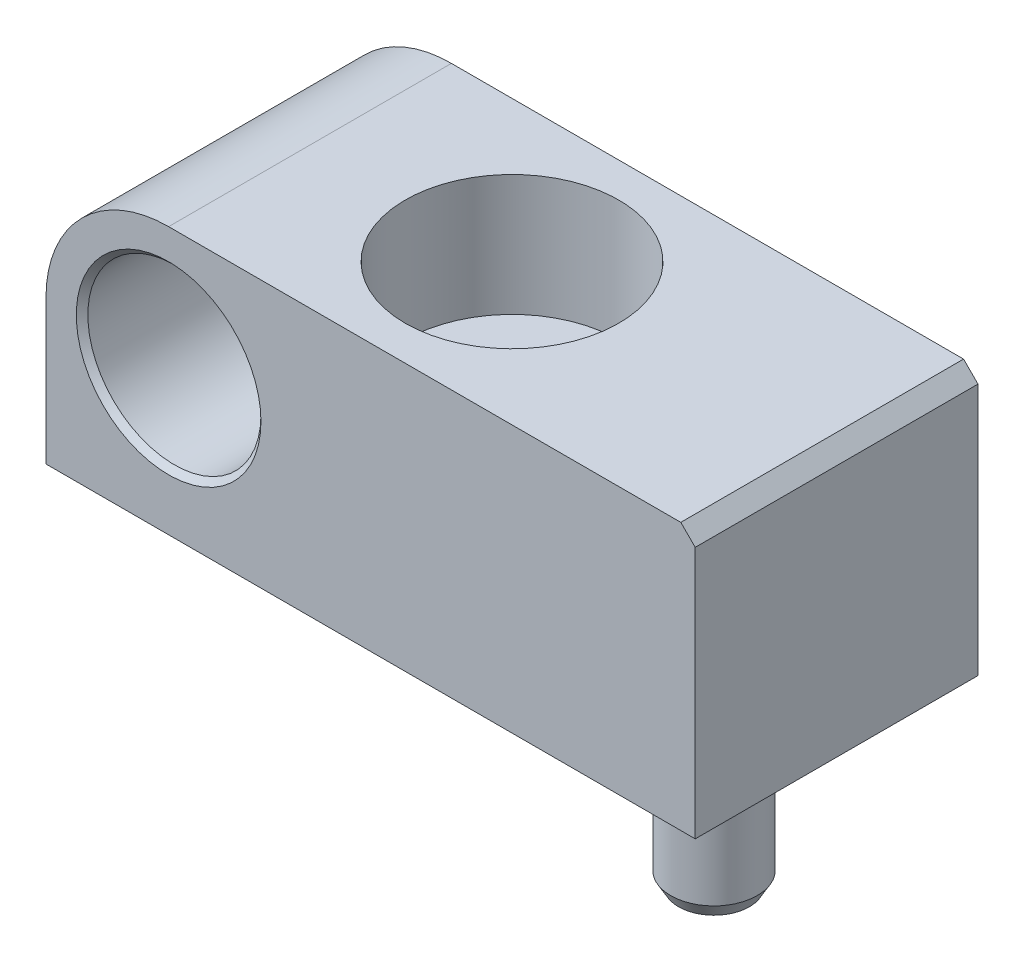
ISO-10303-21;
HEADER;
FILE_DESCRIPTION(('STEP AP214'),'2;1');
FILE_NAME('part.step','',(''),(''),'','','');
FILE_SCHEMA(('AUTOMOTIVE_DESIGN { 1 0 10303 214 1 1 1 1 }'));
ENDSEC;
DATA;
#1=APPLICATION_CONTEXT('core data for automotive mechanical design processes');
#2=APPLICATION_PROTOCOL_DEFINITION('international standard','automotive_design',2000,#1);
#3=PRODUCT_CONTEXT('',#1,'mechanical');
#4=PRODUCT('Part','Part','',(#3));
#5=PRODUCT_RELATED_PRODUCT_CATEGORY('part','',(#4));
#6=PRODUCT_DEFINITION_FORMATION('','',#4);
#7=PRODUCT_DEFINITION_CONTEXT('part definition',#1,'design');
#8=PRODUCT_DEFINITION('design','',#6,#7);
#9=PRODUCT_DEFINITION_SHAPE('','',#8);
#10=(LENGTH_UNIT() NAMED_UNIT(*) SI_UNIT(.MILLI.,.METRE.));
#11=(NAMED_UNIT(*) PLANE_ANGLE_UNIT() SI_UNIT($,.RADIAN.));
#12=(NAMED_UNIT(*) SI_UNIT($,.STERADIAN.) SOLID_ANGLE_UNIT());
#13=UNCERTAINTY_MEASURE_WITH_UNIT(LENGTH_MEASURE(1.E-05),#10,'distance_accuracy_value','');
#14=(GEOMETRIC_REPRESENTATION_CONTEXT(3) GLOBAL_UNCERTAINTY_ASSIGNED_CONTEXT((#13)) GLOBAL_UNIT_ASSIGNED_CONTEXT((#10,
#11,#12)) REPRESENTATION_CONTEXT('',''));
#15=CARTESIAN_POINT('',(0.,0.,0.));
#16=DIRECTION('',(0.,0.,1.));
#17=DIRECTION('',(1.,0.,0.));
#18=AXIS2_PLACEMENT_3D('',#15,#16,#17);
#19=CARTESIAN_POINT('',(-14.,5.,-4.9));
#20=DIRECTION('',(0.,0.,1.));
#21=DIRECTION('',(1.,0.,0.));
#22=AXIS2_PLACEMENT_3D('',#19,#20,#21);
#23=CYLINDRICAL_SURFACE('',#22,3.);
#24=CARTESIAN_POINT('',(-14.,5.,-4.69999999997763));
#25=DIRECTION('',(0.,0.,-1.));
#26=DIRECTION('',(-1.,0.,0.));
#27=AXIS2_PLACEMENT_3D('',#24,#25,#26);
#28=CIRCLE('',#27,2.99999999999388);
#29=CARTESIAN_POINT('',(-16.9999999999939,5.,-4.69999999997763));
#30=VERTEX_POINT('',#29);
#31=EDGE_CURVE('P0_E122',#30,#30,#28,.T.);
#32=ORIENTED_EDGE('',*,*,#31,.T.);
#33=EDGE_LOOP('',(#32));
#34=FACE_BOUND('',#33,.T.);
#35=CARTESIAN_POINT('',(-14.,5.,4.69999999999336));
#36=DIRECTION('',(0.,0.,1.));
#37=DIRECTION('',(1.,0.,0.));
#38=AXIS2_PLACEMENT_3D('',#35,#36,#37);
#39=CIRCLE('',#38,3.00000000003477);
#40=CARTESIAN_POINT('',(-10.9999999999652,5.,4.69999999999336));
#41=VERTEX_POINT('',#40);
#42=EDGE_CURVE('P0_E87',#41,#41,#39,.T.);
#43=ORIENTED_EDGE('',*,*,#42,.T.);
#44=EDGE_LOOP('',(#43));
#45=FACE_BOUND('',#44,.T.);
#46=ADVANCED_FACE('P0_F17',(#34,#45),#23,.F.);
#47=CARTESIAN_POINT('',(-7.,5.05,0.));
#48=DIRECTION('',(0.,1.,0.));
#49=DIRECTION('',(0.,0.,1.));
#50=AXIS2_PLACEMENT_3D('',#47,#48,#49);
#51=CYLINDRICAL_SURFACE('',#50,3.7);
#52=CARTESIAN_POINT('',(-7.,9.25,0.));
#53=DIRECTION('',(0.,1.,0.));
#54=DIRECTION('',(0.,0.,1.));
#55=AXIS2_PLACEMENT_3D('',#52,#53,#54);
#56=CIRCLE('',#55,3.7);
#57=CARTESIAN_POINT('',(-7.,9.25,3.7));
#58=VERTEX_POINT('',#57);
#59=EDGE_CURVE('P0_E20',#58,#58,#56,.F.);
#60=ORIENTED_EDGE('',*,*,#59,.F.);
#61=EDGE_LOOP('',(#60));
#62=FACE_BOUND('',#61,.T.);
#63=CARTESIAN_POINT('',(-7.,5.05,0.));
#64=DIRECTION('',(0.,1.,0.));
#65=DIRECTION('',(0.,0.,1.));
#66=AXIS2_PLACEMENT_3D('',#63,#64,#65);
#67=CIRCLE('',#66,3.7);
#68=CARTESIAN_POINT('',(-7.,5.05,3.7));
#69=VERTEX_POINT('',#68);
#70=EDGE_CURVE('P0_E86',#69,#69,#67,.T.);
#71=ORIENTED_EDGE('',*,*,#70,.F.);
#72=EDGE_LOOP('',(#71));
#73=FACE_BOUND('',#72,.T.);
#74=ADVANCED_FACE('P0_F177',(#62,#73),#51,.F.);
#75=CARTESIAN_POINT('',(-14.,5.,-4.89999999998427));
#76=DIRECTION('',(0.,0.,-1.));
#77=DIRECTION('',(-1.,0.,0.));
#78=AXIS2_PLACEMENT_3D('',#75,#76,#77);
#79=CONICAL_SURFACE('',#78,3.20000000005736,0.785398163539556);
#80=ORIENTED_EDGE('',*,*,#31,.F.);
#81=EDGE_LOOP('',(#80));
#82=FACE_BOUND('',#81,.T.);
#83=CARTESIAN_POINT('',(-14.,5.,-4.89999999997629));
#84=DIRECTION('',(0.,0.,-1.));
#85=DIRECTION('',(-1.,0.,0.));
#86=AXIS2_PLACEMENT_3D('',#83,#84,#85);
#87=CIRCLE('',#86,3.20000000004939);
#88=CARTESIAN_POINT('',(-17.2000000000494,5.,-4.89999999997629));
#89=VERTEX_POINT('',#88);
#90=EDGE_CURVE('P0_E93',#89,#89,#87,.T.);
#91=ORIENTED_EDGE('',*,*,#90,.T.);
#92=EDGE_LOOP('',(#91));
#93=FACE_BOUND('',#92,.T.);
#94=ADVANCED_FACE('P0_F180',(#82,#93),#79,.F.);
#95=CARTESIAN_POINT('',(3.75,9.25,-4.9));
#96=DIRECTION('',(0.707106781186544,0.707106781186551,0.));
#97=DIRECTION('',(-0.707106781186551,0.707106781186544,0.));
#98=AXIS2_PLACEMENT_3D('',#95,#96,#97);
#99=PLANE('',#98);
#100=DIRECTION('',(-0.707106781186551,0.707106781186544,0.));
#101=VECTOR('',#100,1.);
#102=CARTESIAN_POINT('',(3.75,9.25,4.9));
#103=LINE('',#102,#101);
#104=CARTESIAN_POINT('',(3.75,9.25,4.9));
#105=VERTEX_POINT('',#104);
#106=CARTESIAN_POINT('',(4.25,8.75,4.9));
#107=VERTEX_POINT('',#106);
#108=EDGE_CURVE('P0_E120',#105,#107,#103,.F.);
#109=ORIENTED_EDGE('',*,*,#108,.T.);
#110=DIRECTION('',(0.,0.,-1.));
#111=VECTOR('',#110,1.);
#112=CARTESIAN_POINT('',(4.25,8.75,-4.9));
#113=LINE('',#112,#111);
#114=CARTESIAN_POINT('',(4.25,8.75,-4.9));
#115=VERTEX_POINT('',#114);
#116=EDGE_CURVE('P0_E109',#115,#107,#113,.F.);
#117=ORIENTED_EDGE('',*,*,#116,.F.);
#118=DIRECTION('',(-0.70710678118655,0.707106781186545,0.));
#119=VECTOR('',#118,1.);
#120=CARTESIAN_POINT('',(4.25,8.75,-4.9));
#121=LINE('',#120,#119);
#122=CARTESIAN_POINT('',(3.75,9.25,-4.9));
#123=VERTEX_POINT('',#122);
#124=EDGE_CURVE('P0_E77',#115,#123,#121,.T.);
#125=ORIENTED_EDGE('',*,*,#124,.T.);
#126=DIRECTION('',(0.,0.,1.));
#127=VECTOR('',#126,1.);
#128=CARTESIAN_POINT('',(3.75,9.25,-4.9));
#129=LINE('',#128,#127);
#130=EDGE_CURVE('P0_E73',#105,#123,#129,.F.);
#131=ORIENTED_EDGE('',*,*,#130,.F.);
#132=EDGE_LOOP('',(#109,#117,#125,#131));
#133=FACE_BOUND('',#132,.T.);
#134=ADVANCED_FACE('P0_F186',(#133),#99,.T.);
#135=CARTESIAN_POINT('',(-14.,9.25,-4.9));
#136=DIRECTION('',(0.,1.,0.));
#137=DIRECTION('',(0.,0.,1.));
#138=AXIS2_PLACEMENT_3D('',#135,#136,#137);
#139=PLANE('',#138);
#140=ORIENTED_EDGE('',*,*,#59,.T.);
#141=EDGE_LOOP('',(#140));
#142=FACE_BOUND('',#141,.T.);
#143=DIRECTION('',(1.,0.,0.));
#144=VECTOR('',#143,1.);
#145=CARTESIAN_POINT('',(-14.,9.25,4.9));
#146=LINE('',#145,#144);
#147=CARTESIAN_POINT('',(-14.,9.25,4.9));
#148=VERTEX_POINT('',#147);
#149=EDGE_CURVE('P0_E128',#105,#148,#146,.F.);
#150=ORIENTED_EDGE('',*,*,#149,.F.);
#151=ORIENTED_EDGE('',*,*,#130,.T.);
#152=DIRECTION('',(1.,0.,0.));
#153=VECTOR('',#152,1.);
#154=CARTESIAN_POINT('',(-14.,9.25,-4.9));
#155=LINE('',#154,#153);
#156=CARTESIAN_POINT('',(-14.,9.25,-4.9));
#157=VERTEX_POINT('',#156);
#158=EDGE_CURVE('P0_E66',#123,#157,#155,.F.);
#159=ORIENTED_EDGE('',*,*,#158,.T.);
#160=DIRECTION('',(0.,0.,1.));
#161=VECTOR('',#160,1.);
#162=CARTESIAN_POINT('',(-14.,9.25,-4.9));
#163=LINE('',#162,#161);
#164=EDGE_CURVE('P0_E70',#148,#157,#163,.F.);
#165=ORIENTED_EDGE('',*,*,#164,.F.);
#166=EDGE_LOOP('',(#150,#151,#159,#165));
#167=FACE_BOUND('',#166,.T.);
#168=ADVANCED_FACE('P0_F69',(#142,#167),#139,.T.);
#169=CARTESIAN_POINT('',(-14.,5.,4.89999999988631));
#170=DIRECTION('',(0.,0.,1.));
#171=DIRECTION('',(1.,0.,0.));
#172=AXIS2_PLACEMENT_3D('',#169,#170,#171);
#173=CONICAL_SURFACE('',#172,3.19999999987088,0.78539816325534);
#174=ORIENTED_EDGE('',*,*,#42,.F.);
#175=EDGE_LOOP('',(#174));
#176=FACE_BOUND('',#175,.T.);
#177=CARTESIAN_POINT('',(-14.,5.,4.89999999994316));
#178=DIRECTION('',(0.,0.,1.));
#179=DIRECTION('',(1.,0.,0.));
#180=AXIS2_PLACEMENT_3D('',#177,#178,#179);
#181=CIRCLE('',#180,3.19999999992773);
#182=CARTESIAN_POINT('',(-10.8000000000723,5.,4.89999999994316));
#183=VERTEX_POINT('',#182);
#184=EDGE_CURVE('P0_E144',#183,#183,#181,.F.);
#185=ORIENTED_EDGE('',*,*,#184,.F.);
#186=EDGE_LOOP('',(#185));
#187=FACE_BOUND('',#186,.T.);
#188=ADVANCED_FACE('P0_F228',(#176,#187),#173,.F.);
#189=CARTESIAN_POINT('',(-14.,5.,-4.9));
#190=DIRECTION('',(0.,0.,1.));
#191=DIRECTION('',(1.,0.,0.));
#192=AXIS2_PLACEMENT_3D('',#189,#190,#191);
#193=CYLINDRICAL_SURFACE('',#192,4.25);
#194=CARTESIAN_POINT('',(-14.,5.,4.9));
#195=DIRECTION('',(0.,0.,1.));
#196=DIRECTION('',(1.,0.,0.));
#197=AXIS2_PLACEMENT_3D('',#194,#195,#196);
#198=CIRCLE('',#197,4.25);
#199=CARTESIAN_POINT('',(-18.25,5.,4.9));
#200=VERTEX_POINT('',#199);
#201=EDGE_CURVE('P0_E84',#148,#200,#198,.T.);
#202=ORIENTED_EDGE('',*,*,#201,.F.);
#203=ORIENTED_EDGE('',*,*,#164,.T.);
#204=CARTESIAN_POINT('',(-14.,5.,-4.9));
#205=DIRECTION('',(0.,0.,1.));
#206=DIRECTION('',(1.,0.,0.));
#207=AXIS2_PLACEMENT_3D('',#204,#205,#206);
#208=CIRCLE('',#207,4.25);
#209=CARTESIAN_POINT('',(-18.25,5.,-4.9));
#210=VERTEX_POINT('',#209);
#211=EDGE_CURVE('P0_E76',#157,#210,#208,.T.);
#212=ORIENTED_EDGE('',*,*,#211,.T.);
#213=DIRECTION('',(0.,0.,1.));
#214=VECTOR('',#213,1.);
#215=CARTESIAN_POINT('',(-18.25,5.,-4.9));
#216=LINE('',#215,#214);
#217=EDGE_CURVE('P0_E143',#200,#210,#216,.F.);
#218=ORIENTED_EDGE('',*,*,#217,.F.);
#219=EDGE_LOOP('',(#202,#203,#212,#218));
#220=FACE_BOUND('',#219,.T.);
#221=ADVANCED_FACE('P0_F81',(#220),#193,.T.);
#222=CARTESIAN_POINT('',(-7.,5.05,0.));
#223=DIRECTION('',(0.,1.,0.));
#224=DIRECTION('',(0.,0.,1.));
#225=AXIS2_PLACEMENT_3D('',#222,#223,#224);
#226=PLANE('',#225);
#227=CARTESIAN_POINT('',(-7.,5.05,0.));
#228=DIRECTION('',(0.,1.,0.));
#229=DIRECTION('',(0.,0.,1.));
#230=AXIS2_PLACEMENT_3D('',#227,#228,#229);
#231=CIRCLE('',#230,2.15);
#232=CARTESIAN_POINT('',(-7.,5.05,2.15));
#233=VERTEX_POINT('',#232);
#234=EDGE_CURVE('P0_E140',#233,#233,#231,.F.);
#235=ORIENTED_EDGE('',*,*,#234,.T.);
#236=EDGE_LOOP('',(#235));
#237=FACE_BOUND('',#236,.T.);
#238=ORIENTED_EDGE('',*,*,#70,.T.);
#239=EDGE_LOOP('',(#238));
#240=FACE_BOUND('',#239,.T.);
#241=ADVANCED_FACE('P0_F221',(#237,#240),#226,.T.);
#242=CARTESIAN_POINT('',(0.,6.,0.));
#243=DIRECTION('',(0.,-1.,0.));
#244=DIRECTION('',(1.,0.,0.));
#245=AXIS2_PLACEMENT_3D('',#242,#243,#244);
#246=PLANE('',#245);
#247=CARTESIAN_POINT('',(0.,6.,0.));
#248=DIRECTION('',(0.,-1.,0.));
#249=DIRECTION('',(1.,0.,0.));
#250=AXIS2_PLACEMENT_3D('',#247,#248,#249);
#251=CIRCLE('',#250,1.5);
#252=CARTESIAN_POINT('',(1.5,6.,0.));
#253=VERTEX_POINT('',#252);
#254=EDGE_CURVE('P0_E136',#253,#253,#251,.T.);
#255=ORIENTED_EDGE('',*,*,#254,.T.);
#256=EDGE_LOOP('',(#255));
#257=FACE_BOUND('',#256,.T.);
#258=ADVANCED_FACE('P0_F217',(#257),#246,.T.);
#259=CARTESIAN_POINT('',(-14.,5.,-4.9));
#260=DIRECTION('',(0.,0.,1.));
#261=DIRECTION('',(1.,0.,0.));
#262=AXIS2_PLACEMENT_3D('',#259,#260,#261);
#263=PLANE('',#262);
#264=ORIENTED_EDGE('',*,*,#90,.F.);
#265=EDGE_LOOP('',(#264));
#266=FACE_BOUND('',#265,.T.);
#267=ORIENTED_EDGE('',*,*,#211,.F.);
#268=ORIENTED_EDGE('',*,*,#158,.F.);
#269=ORIENTED_EDGE('',*,*,#124,.F.);
#270=DIRECTION('',(0.,1.,0.));
#271=VECTOR('',#270,1.);
#272=CARTESIAN_POINT('',(4.25,0.,-4.9));
#273=LINE('',#272,#271);
#274=CARTESIAN_POINT('',(4.25,0.,-4.9));
#275=VERTEX_POINT('',#274);
#276=EDGE_CURVE('P0_E96',#275,#115,#273,.T.);
#277=ORIENTED_EDGE('',*,*,#276,.F.);
#278=DIRECTION('',(1.,0.,0.));
#279=VECTOR('',#278,1.);
#280=CARTESIAN_POINT('',(4.25,0.,-4.9));
#281=LINE('',#280,#279);
#282=CARTESIAN_POINT('',(-18.25,0.,-4.9));
#283=VERTEX_POINT('',#282);
#284=EDGE_CURVE('P0_E139',#283,#275,#281,.T.);
#285=ORIENTED_EDGE('',*,*,#284,.F.);
#286=DIRECTION('',(0.,-1.,0.));
#287=VECTOR('',#286,1.);
#288=CARTESIAN_POINT('',(-18.25,0.,-4.9));
#289=LINE('',#288,#287);
#290=EDGE_CURVE('P0_E91',#210,#283,#289,.T.);
#291=ORIENTED_EDGE('',*,*,#290,.F.);
#292=EDGE_LOOP('',(#267,#268,#269,#277,#285,#291));
#293=FACE_BOUND('',#292,.T.);
#294=ADVANCED_FACE('P0_F89',(#266,#293),#263,.F.);
#295=CARTESIAN_POINT('',(4.25,0.,-4.9));
#296=DIRECTION('',(1.,0.,0.));
#297=DIRECTION('',(0.,0.,-1.));
#298=AXIS2_PLACEMENT_3D('',#295,#296,#297);
#299=PLANE('',#298);
#300=DIRECTION('',(0.,1.,0.));
#301=VECTOR('',#300,1.);
#302=CARTESIAN_POINT('',(4.25,5.,4.9));
#303=LINE('',#302,#301);
#304=CARTESIAN_POINT('',(4.25,0.,4.9));
#305=VERTEX_POINT('',#304);
#306=EDGE_CURVE('P0_E125',#305,#107,#303,.T.);
#307=ORIENTED_EDGE('',*,*,#306,.F.);
#308=DIRECTION('',(0.,0.,1.));
#309=VECTOR('',#308,1.);
#310=CARTESIAN_POINT('',(4.25,0.,-4.9));
#311=LINE('',#310,#309);
#312=EDGE_CURVE('P0_E163',#275,#305,#311,.T.);
#313=ORIENTED_EDGE('',*,*,#312,.F.);
#314=ORIENTED_EDGE('',*,*,#276,.T.);
#315=ORIENTED_EDGE('',*,*,#116,.T.);
#316=EDGE_LOOP('',(#307,#313,#314,#315));
#317=FACE_BOUND('',#316,.T.);
#318=ADVANCED_FACE('P0_F210',(#317),#299,.T.);
#319=CARTESIAN_POINT('',(-14.,5.,4.9));
#320=DIRECTION('',(0.,0.,1.));
#321=DIRECTION('',(1.,0.,0.));
#322=AXIS2_PLACEMENT_3D('',#319,#320,#321);
#323=PLANE('',#322);
#324=ORIENTED_EDGE('',*,*,#184,.T.);
#325=EDGE_LOOP('',(#324));
#326=FACE_BOUND('',#325,.T.);
#327=ORIENTED_EDGE('',*,*,#108,.F.);
#328=ORIENTED_EDGE('',*,*,#149,.T.);
#329=ORIENTED_EDGE('',*,*,#201,.T.);
#330=DIRECTION('',(0.,-1.,0.));
#331=VECTOR('',#330,1.);
#332=CARTESIAN_POINT('',(-18.25,0.,4.9));
#333=LINE('',#332,#331);
#334=CARTESIAN_POINT('',(-18.25,0.,4.9));
#335=VERTEX_POINT('',#334);
#336=EDGE_CURVE('P0_E35',#335,#200,#333,.F.);
#337=ORIENTED_EDGE('',*,*,#336,.F.);
#338=DIRECTION('',(1.,0.,0.));
#339=VECTOR('',#338,1.);
#340=CARTESIAN_POINT('',(4.25,0.,4.9));
#341=LINE('',#340,#339);
#342=EDGE_CURVE('P0_E159',#305,#335,#341,.F.);
#343=ORIENTED_EDGE('',*,*,#342,.F.);
#344=ORIENTED_EDGE('',*,*,#306,.T.);
#345=EDGE_LOOP('',(#327,#328,#329,#337,#343,#344));
#346=FACE_BOUND('',#345,.T.);
#347=ADVANCED_FACE('P0_F146',(#326,#346),#323,.T.);
#348=CARTESIAN_POINT('',(-18.25,0.,-4.9));
#349=DIRECTION('',(-1.,0.,0.));
#350=DIRECTION('',(0.,-1.,0.));
#351=AXIS2_PLACEMENT_3D('',#348,#349,#350);
#352=PLANE('',#351);
#353=ORIENTED_EDGE('',*,*,#336,.T.);
#354=ORIENTED_EDGE('',*,*,#217,.T.);
#355=ORIENTED_EDGE('',*,*,#290,.T.);
#356=DIRECTION('',(0.,0.,1.));
#357=VECTOR('',#356,1.);
#358=CARTESIAN_POINT('',(-18.25,0.,-4.9));
#359=LINE('',#358,#357);
#360=EDGE_CURVE('P0_E135',#335,#283,#359,.F.);
#361=ORIENTED_EDGE('',*,*,#360,.F.);
#362=EDGE_LOOP('',(#353,#354,#355,#361));
#363=FACE_BOUND('',#362,.T.);
#364=ADVANCED_FACE('P0_F149',(#363),#352,.T.);
#365=CARTESIAN_POINT('',(-7.,0.,0.));
#366=DIRECTION('',(0.,1.,0.));
#367=DIRECTION('',(0.,0.,1.));
#368=AXIS2_PLACEMENT_3D('',#365,#366,#367);
#369=CYLINDRICAL_SURFACE('',#368,2.15);
#370=ORIENTED_EDGE('',*,*,#234,.F.);
#371=EDGE_LOOP('',(#370));
#372=FACE_BOUND('',#371,.T.);
#373=CARTESIAN_POINT('',(-7.,0.,0.));
#374=DIRECTION('',(0.,1.,0.));
#375=DIRECTION('',(0.,0.,1.));
#376=AXIS2_PLACEMENT_3D('',#373,#374,#375);
#377=CIRCLE('',#376,2.15);
#378=CARTESIAN_POINT('',(-7.,0.,2.15));
#379=VERTEX_POINT('',#378);
#380=EDGE_CURVE('P0_E26',#379,#379,#377,.T.);
#381=ORIENTED_EDGE('',*,*,#380,.F.);
#382=EDGE_LOOP('',(#381));
#383=FACE_BOUND('',#382,.T.);
#384=ADVANCED_FACE('P0_F198',(#372,#383),#369,.F.);
#385=CARTESIAN_POINT('',(0.,6.,0.));
#386=DIRECTION('',(0.,-1.,0.));
#387=DIRECTION('',(1.,0.,0.));
#388=AXIS2_PLACEMENT_3D('',#385,#386,#387);
#389=CYLINDRICAL_SURFACE('',#388,1.5);
#390=ORIENTED_EDGE('',*,*,#254,.F.);
#391=EDGE_LOOP('',(#390));
#392=FACE_BOUND('',#391,.T.);
#393=CARTESIAN_POINT('',(0.,0.,0.));
#394=DIRECTION('',(0.,-1.,0.));
#395=DIRECTION('',(1.,0.,0.));
#396=AXIS2_PLACEMENT_3D('',#393,#394,#395);
#397=CIRCLE('',#396,1.5);
#398=CARTESIAN_POINT('',(1.5,0.,0.));
#399=VERTEX_POINT('',#398);
#400=EDGE_CURVE('P0_E11',#399,#399,#397,.F.);
#401=ORIENTED_EDGE('',*,*,#400,.F.);
#402=EDGE_LOOP('',(#401));
#403=FACE_BOUND('',#402,.T.);
#404=ADVANCED_FACE('P0_F192',(#392,#403),#389,.F.);
#405=CARTESIAN_POINT('',(4.25,0.,-4.9));
#406=DIRECTION('',(0.,-1.,0.));
#407=DIRECTION('',(1.,0.,0.));
#408=AXIS2_PLACEMENT_3D('',#405,#406,#407);
#409=PLANE('',#408);
#410=ORIENTED_EDGE('',*,*,#400,.T.);
#411=EDGE_LOOP('',(#410));
#412=FACE_BOUND('',#411,.T.);
#413=ORIENTED_EDGE('',*,*,#380,.T.);
#414=EDGE_LOOP('',(#413));
#415=FACE_BOUND('',#414,.T.);
#416=ORIENTED_EDGE('',*,*,#342,.T.);
#417=ORIENTED_EDGE('',*,*,#360,.T.);
#418=ORIENTED_EDGE('',*,*,#284,.T.);
#419=ORIENTED_EDGE('',*,*,#312,.T.);
#420=EDGE_LOOP('',(#416,#417,#418,#419));
#421=FACE_BOUND('',#420,.T.);
#422=ADVANCED_FACE('P0_F190',(#412,#415,#421),#409,.T.);
#423=CLOSED_SHELL('',(#46,#74,#94,#134,#168,#188,#221,#241,#258,#294,#318,#347,#364,#384,#404,#422));
#424=MANIFOLD_SOLID_BREP('P0_B1',#423);
#425=CARTESIAN_POINT('',(0.,6.,0.));
#426=DIRECTION('',(0.,1.,0.));
#427=DIRECTION('',(-1.,0.,0.));
#428=AXIS2_PLACEMENT_3D('',#425,#426,#427);
#429=PLANE('',#428);
#430=CARTESIAN_POINT('',(0.,6.,0.));
#431=DIRECTION('',(0.,1.,0.));
#432=DIRECTION('',(-1.,0.,0.));
#433=AXIS2_PLACEMENT_3D('',#430,#431,#432);
#434=CIRCLE('',#433,1.08281182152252);
#435=CARTESIAN_POINT('',(-1.08281182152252,6.,0.));
#436=VERTEX_POINT('',#435);
#437=EDGE_CURVE('P1_E9',#436,#436,#434,.T.);
#438=ORIENTED_EDGE('',*,*,#437,.T.);
#439=EDGE_LOOP('',(#438));
#440=FACE_BOUND('',#439,.T.);
#441=ADVANCED_FACE('P1_F13',(#440),#429,.T.);
#442=CARTESIAN_POINT('',(0.,5.58281182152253,0.));
#443=DIRECTION('',(0.,1.,0.));
#444=DIRECTION('',(-1.,0.,0.));
#445=AXIS2_PLACEMENT_3D('',#442,#443,#444);
#446=TOROIDAL_SURFACE('',#445,1.08281182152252,0.417188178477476);
#447=CARTESIAN_POINT('',(0.,5.58281182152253,0.));
#448=DIRECTION('',(0.,1.,0.));
#449=DIRECTION('',(-1.,0.,0.));
#450=AXIS2_PLACEMENT_3D('',#447,#448,#449);
#451=CIRCLE('',#450,1.5);
#452=CARTESIAN_POINT('',(-1.5,5.58281182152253,0.));
#453=VERTEX_POINT('',#452);
#454=EDGE_CURVE('P1_E19',#453,#453,#451,.T.);
#455=ORIENTED_EDGE('',*,*,#454,.T.);
#456=EDGE_LOOP('',(#455));
#457=FACE_BOUND('',#456,.T.);
#458=ORIENTED_EDGE('',*,*,#437,.F.);
#459=EDGE_LOOP('',(#458));
#460=FACE_BOUND('',#459,.T.);
#461=ADVANCED_FACE('P1_F46',(#457,#460),#446,.T.);
#462=CARTESIAN_POINT('',(0.,7.2163229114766,0.));
#463=DIRECTION('',(0.,1.,0.));
#464=DIRECTION('',(-1.,0.,0.));
#465=AXIS2_PLACEMENT_3D('',#462,#463,#464);
#466=CYLINDRICAL_SURFACE('',#465,1.5);
#467=CARTESIAN_POINT('',(0.,-5.52815200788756,0.));
#468=DIRECTION('',(0.,1.,0.));
#469=DIRECTION('',(-1.,0.,0.));
#470=AXIS2_PLACEMENT_3D('',#467,#468,#469);
#471=CIRCLE('',#470,1.5);
#472=CARTESIAN_POINT('',(-1.5,-5.52815200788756,0.));
#473=VERTEX_POINT('',#472);
#474=EDGE_CURVE('P1_E23',#473,#473,#471,.T.);
#475=ORIENTED_EDGE('',*,*,#474,.T.);
#476=EDGE_LOOP('',(#475));
#477=FACE_BOUND('',#476,.T.);
#478=ORIENTED_EDGE('',*,*,#454,.F.);
#479=EDGE_LOOP('',(#478));
#480=FACE_BOUND('',#479,.T.);
#481=ADVANCED_FACE('P1_F43',(#477,#480),#466,.T.);
#482=CARTESIAN_POINT('',(0.,-5.52815200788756,0.));
#483=DIRECTION('',(0.,1.,0.));
#484=DIRECTION('',(-1.,0.,0.));
#485=AXIS2_PLACEMENT_3D('',#482,#483,#484);
#486=CONICAL_SURFACE('',#485,1.5,0.522020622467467);
#487=CARTESIAN_POINT('',(0.,-6.,0.));
#488=DIRECTION('',(0.,1.,0.));
#489=DIRECTION('',(-1.,0.,0.));
#490=AXIS2_PLACEMENT_3D('',#487,#488,#489);
#491=CIRCLE('',#490,1.22857039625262);
#492=CARTESIAN_POINT('',(-1.22857039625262,-6.,0.));
#493=VERTEX_POINT('',#492);
#494=EDGE_CURVE('P1_E27',#493,#493,#491,.T.);
#495=ORIENTED_EDGE('',*,*,#494,.T.);
#496=EDGE_LOOP('',(#495));
#497=FACE_BOUND('',#496,.T.);
#498=ORIENTED_EDGE('',*,*,#474,.F.);
#499=EDGE_LOOP('',(#498));
#500=FACE_BOUND('',#499,.T.);
#501=ADVANCED_FACE('P1_F33',(#497,#500),#486,.T.);
#502=CARTESIAN_POINT('',(-1.22857039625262,-6.,0.));
#503=DIRECTION('',(0.,-1.,0.));
#504=DIRECTION('',(1.,0.,0.));
#505=AXIS2_PLACEMENT_3D('',#502,#503,#504);
#506=PLANE('',#505);
#507=ORIENTED_EDGE('',*,*,#494,.F.);
#508=EDGE_LOOP('',(#507));
#509=FACE_BOUND('',#508,.T.);
#510=ADVANCED_FACE('P1_F36',(#509),#506,.T.);
#511=CLOSED_SHELL('',(#441,#461,#481,#501,#510));
#512=MANIFOLD_SOLID_BREP('P1_B1',#511);
#513=ADVANCED_BREP_SHAPE_REPRESENTATION('',(#18,#424,#512),#14);
#514=SHAPE_DEFINITION_REPRESENTATION(#9,#513);
ENDSEC;
END-ISO-10303-21;
